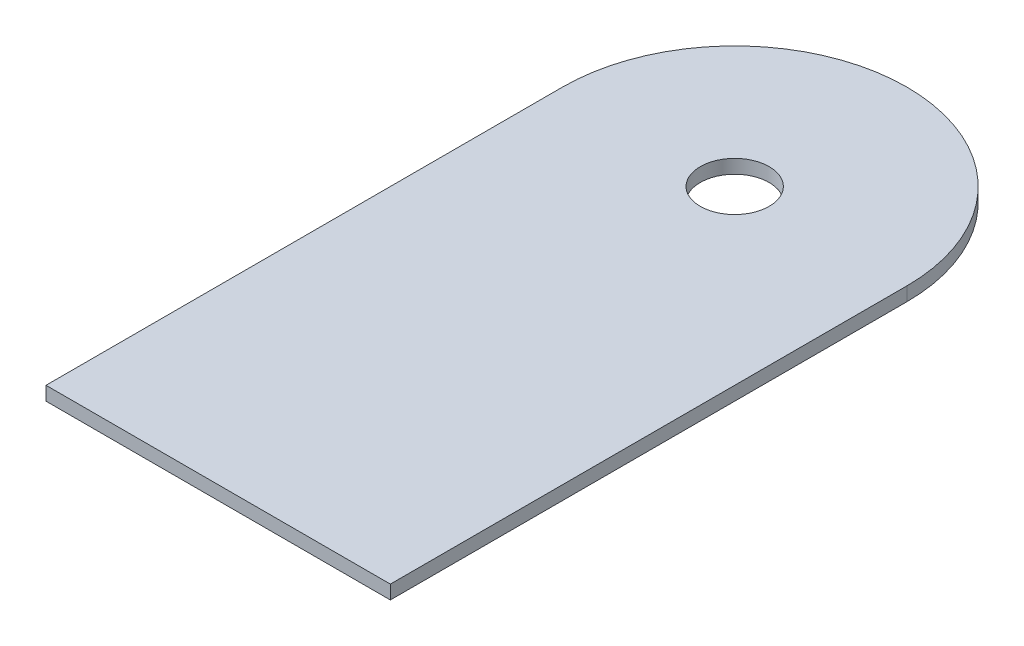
from build123d import *

# Parameters (mm, degrees)
SKETCH2_R           = 5
BOSS_EXTRUDE1_DEPTH = 2


with BuildPart() as part:
    # Sketch2 → Boss-Extrude1 (new body)
    with BuildSketch(Plane(origin=(0, 0, 0), x_dir=(1, 0, 0), z_dir=(0, 1, 0))):
        with BuildLine():
            Line((25, 0), (25, -75))
            Line((25, -75), (-25, -75))
            Line((-25, -75), (-25, 0))
            ThreePointArc((-25, 0), (0, 25), (25, 0))
        make_face()
        with Locations(Location((0, 0, 0), (0, 0, 270))):
            Circle(SKETCH2_R, mode=Mode.SUBTRACT)
    extrude(amount=BOSS_EXTRUDE1_DEPTH)


solid = part.part
